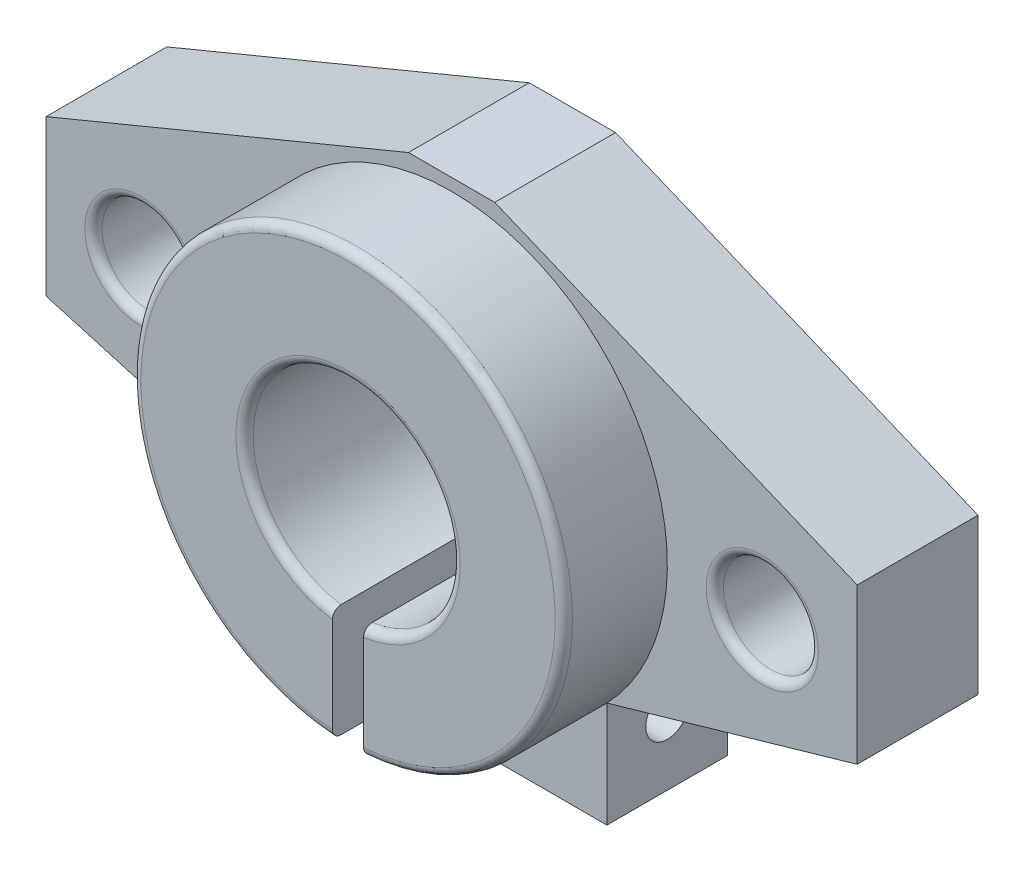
ISO-10303-21;
HEADER;
FILE_DESCRIPTION(('STEP AP214'),'2;1');
FILE_NAME('part.step','',(''),(''),'','','');
FILE_SCHEMA(('AUTOMOTIVE_DESIGN { 1 0 10303 214 1 1 1 1 }'));
ENDSEC;
DATA;
#1=APPLICATION_CONTEXT('core data for automotive mechanical design processes');
#2=APPLICATION_PROTOCOL_DEFINITION('international standard','automotive_design',2000,#1);
#3=PRODUCT_CONTEXT('',#1,'mechanical');
#4=PRODUCT('Part','Part','',(#3));
#5=PRODUCT_RELATED_PRODUCT_CATEGORY('part','',(#4));
#6=PRODUCT_DEFINITION_FORMATION('','',#4);
#7=PRODUCT_DEFINITION_CONTEXT('part definition',#1,'design');
#8=PRODUCT_DEFINITION('design','',#6,#7);
#9=PRODUCT_DEFINITION_SHAPE('','',#8);
#10=(LENGTH_UNIT() NAMED_UNIT(*) SI_UNIT(.MILLI.,.METRE.));
#11=(NAMED_UNIT(*) PLANE_ANGLE_UNIT() SI_UNIT($,.RADIAN.));
#12=(NAMED_UNIT(*) SI_UNIT($,.STERADIAN.) SOLID_ANGLE_UNIT());
#13=UNCERTAINTY_MEASURE_WITH_UNIT(LENGTH_MEASURE(1.E-05),#10,'distance_accuracy_value','');
#14=(GEOMETRIC_REPRESENTATION_CONTEXT(3) GLOBAL_UNCERTAINTY_ASSIGNED_CONTEXT((#13)) GLOBAL_UNIT_ASSIGNED_CONTEXT((#10,
#11,#12)) REPRESENTATION_CONTEXT('',''));
#15=CARTESIAN_POINT('',(0.,0.,0.));
#16=DIRECTION('',(0.,0.,1.));
#17=DIRECTION('',(1.,0.,0.));
#18=AXIS2_PLACEMENT_3D('',#15,#16,#17);
#19=CARTESIAN_POINT('',(0.,0.,7.));
#20=DIRECTION('',(0.,0.,1.));
#21=DIRECTION('',(1.,0.,0.));
#22=AXIS2_PLACEMENT_3D('',#19,#20,#21);
#23=PLANE('',#22);
#24=DIRECTION('',(0.,1.,0.));
#25=VECTOR('',#24,1.);
#26=CARTESIAN_POINT('',(9.,0.,7.));
#27=LINE('',#26,#25);
#28=CARTESIAN_POINT('',(9.,-14.801515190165,7.));
#29=VERTEX_POINT('',#28);
#30=CARTESIAN_POINT('',(8.99999999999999,-8.67467578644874,7.));
#31=VERTEX_POINT('',#30);
#32=EDGE_CURVE('E183',#29,#31,#27,.T.);
#33=ORIENTED_EDGE('',*,*,#32,.T.);
#34=CARTESIAN_POINT('',(0.,0.,7.));
#35=DIRECTION('',(0.,0.,1.));
#36=DIRECTION('',(1.,0.,0.));
#37=AXIS2_PLACEMENT_3D('',#34,#35,#36);
#38=CIRCLE('',#37,12.5);
#39=CARTESIAN_POINT('',(0.900000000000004,-12.467557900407,7.));
#40=VERTEX_POINT('',#39);
#41=EDGE_CURVE('E171',#31,#40,#38,.F.);
#42=ORIENTED_EDGE('',*,*,#41,.T.);
#43=DIRECTION('',(0.,1.,0.));
#44=VECTOR('',#43,1.);
#45=CARTESIAN_POINT('',(0.900000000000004,0.,7.));
#46=LINE('',#45,#44);
#47=CARTESIAN_POINT('',(0.900000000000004,-14.801515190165,7.));
#48=VERTEX_POINT('',#47);
#49=EDGE_CURVE('E181',#48,#40,#46,.T.);
#50=ORIENTED_EDGE('',*,*,#49,.F.);
#51=DIRECTION('',(1.,0.,0.));
#52=VECTOR('',#51,1.);
#53=CARTESIAN_POINT('',(0.,-14.801515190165,7.));
#54=LINE('',#53,#52);
#55=EDGE_CURVE('E194',#48,#29,#54,.T.);
#56=ORIENTED_EDGE('',*,*,#55,.T.);
#57=EDGE_LOOP('',(#33,#42,#50,#56));
#58=FACE_BOUND('',#57,.T.);
#59=ADVANCED_FACE('F35',(#58),#23,.T.);
#60=DIRECTION('',(0.,-1.,0.));
#61=VECTOR('',#60,1.);
#62=CARTESIAN_POINT('',(-0.899999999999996,0.,7.));
#63=LINE('',#62,#61);
#64=CARTESIAN_POINT('',(-0.899999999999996,-12.467557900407,7.));
#65=VERTEX_POINT('',#64);
#66=CARTESIAN_POINT('',(-0.899999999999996,-14.801515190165,7.));
#67=VERTEX_POINT('',#66);
#68=EDGE_CURVE('E195',#65,#67,#63,.T.);
#69=ORIENTED_EDGE('',*,*,#68,.F.);
#70=CARTESIAN_POINT('',(-9.,-8.67467578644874,7.));
#71=VERTEX_POINT('',#70);
#72=EDGE_CURVE('E186',#65,#71,#38,.F.);
#73=ORIENTED_EDGE('',*,*,#72,.T.);
#74=DIRECTION('',(0.,1.,0.));
#75=VECTOR('',#74,1.);
#76=CARTESIAN_POINT('',(-9.,0.,7.));
#77=LINE('',#76,#75);
#78=CARTESIAN_POINT('',(-9.,-14.801515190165,7.));
#79=VERTEX_POINT('',#78);
#80=EDGE_CURVE('E452',#79,#71,#77,.T.);
#81=ORIENTED_EDGE('',*,*,#80,.F.);
#82=DIRECTION('',(1.,0.,0.));
#83=VECTOR('',#82,1.);
#84=CARTESIAN_POINT('',(0.,-14.801515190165,7.));
#85=LINE('',#84,#83);
#86=EDGE_CURVE('E198',#79,#67,#85,.T.);
#87=ORIENTED_EDGE('',*,*,#86,.T.);
#88=EDGE_LOOP('',(#69,#73,#81,#87));
#89=FACE_BOUND('',#88,.T.);
#90=ADVANCED_FACE('F426',(#89),#23,.T.);
#91=CARTESIAN_POINT('',(-18.,0.,7.));
#92=DIRECTION('',(0.,0.,1.));
#93=DIRECTION('',(1.,0.,0.));
#94=AXIS2_PLACEMENT_3D('',#91,#92,#93);
#95=CIRCLE('',#94,3.25);
#96=CARTESIAN_POINT('',(-14.75,0.,7.));
#97=VERTEX_POINT('',#96);
#98=EDGE_CURVE('E386',#97,#97,#95,.F.);
#99=ORIENTED_EDGE('',*,*,#98,.T.);
#100=EDGE_LOOP('',(#99));
#101=FACE_BOUND('',#100,.T.);
#102=CARTESIAN_POINT('',(18.,0.,7.));
#103=DIRECTION('',(0.,0.,1.));
#104=DIRECTION('',(1.,0.,0.));
#105=AXIS2_PLACEMENT_3D('',#102,#103,#104);
#106=CIRCLE('',#105,3.25);
#107=CARTESIAN_POINT('',(21.25,0.,7.));
#108=VERTEX_POINT('',#107);
#109=EDGE_CURVE('E391',#108,#108,#106,.F.);
#110=ORIENTED_EDGE('',*,*,#109,.T.);
#111=EDGE_LOOP('',(#110));
#112=FACE_BOUND('',#111,.T.);
#113=DIRECTION('',(0.960964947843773,-0.276670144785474,0.));
#114=VECTOR('',#113,1.);
#115=CARTESIAN_POINT('',(-2.99525607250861,-10.4034936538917,7.));
#116=LINE('',#115,#114);
#117=CARTESIAN_POINT('',(-23.5,-4.5,7.));
#118=VERTEX_POINT('',#117);
#119=EDGE_CURVE('E253',#118,#71,#116,.T.);
#120=ORIENTED_EDGE('',*,*,#119,.T.);
#121=EDGE_CURVE('E188',#71,#31,#38,.F.);
#122=ORIENTED_EDGE('',*,*,#121,.T.);
#123=DIRECTION('',(-0.960964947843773,-0.276670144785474,0.));
#124=VECTOR('',#123,1.);
#125=CARTESIAN_POINT('',(2.99525607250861,-10.4034936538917,7.));
#126=LINE('',#125,#124);
#127=CARTESIAN_POINT('',(23.5,-4.5,7.));
#128=VERTEX_POINT('',#127);
#129=EDGE_CURVE('E203',#128,#31,#126,.T.);
#130=ORIENTED_EDGE('',*,*,#129,.F.);
#131=DIRECTION('',(0.,1.,0.));
#132=VECTOR('',#131,1.);
#133=CARTESIAN_POINT('',(23.5,0.,7.));
#134=LINE('',#133,#132);
#135=CARTESIAN_POINT('',(23.5,4.5,7.));
#136=VERTEX_POINT('',#135);
#137=EDGE_CURVE('E206',#128,#136,#134,.T.);
#138=ORIENTED_EDGE('',*,*,#137,.T.);
#139=DIRECTION('',(-0.923879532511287,0.38268343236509,0.));
#140=VECTOR('',#139,1.);
#141=CARTESIAN_POINT('',(5.03248557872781,12.1494949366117,7.));
#142=LINE('',#141,#140);
#143=CARTESIAN_POINT('',(2.5,13.198484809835,7.));
#144=VERTEX_POINT('',#143);
#145=EDGE_CURVE('E208',#136,#144,#142,.T.);
#146=ORIENTED_EDGE('',*,*,#145,.T.);
#147=DIRECTION('',(1.,0.,0.));
#148=VECTOR('',#147,1.);
#149=CARTESIAN_POINT('',(0.,13.198484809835,7.));
#150=LINE('',#149,#148);
#151=CARTESIAN_POINT('',(-2.5,13.198484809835,7.));
#152=VERTEX_POINT('',#151);
#153=EDGE_CURVE('E210',#152,#144,#150,.T.);
#154=ORIENTED_EDGE('',*,*,#153,.F.);
#155=DIRECTION('',(0.923879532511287,0.38268343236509,0.));
#156=VECTOR('',#155,1.);
#157=CARTESIAN_POINT('',(-5.03248557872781,12.1494949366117,7.));
#158=LINE('',#157,#156);
#159=CARTESIAN_POINT('',(-23.5,4.5,7.));
#160=VERTEX_POINT('',#159);
#161=EDGE_CURVE('E213',#160,#152,#158,.T.);
#162=ORIENTED_EDGE('',*,*,#161,.F.);
#163=DIRECTION('',(0.,-1.,0.));
#164=VECTOR('',#163,1.);
#165=CARTESIAN_POINT('',(-23.5,0.,7.));
#166=LINE('',#165,#164);
#167=EDGE_CURVE('E216',#160,#118,#166,.T.);
#168=ORIENTED_EDGE('',*,*,#167,.T.);
#169=EDGE_LOOP('',(#120,#122,#130,#138,#146,#154,#162,#168));
#170=FACE_BOUND('',#169,.T.);
#171=ADVANCED_FACE('F428',(#101,#112,#170),#23,.T.);
#172=CARTESIAN_POINT('',(-2.99525607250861,-10.4034936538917,7.));
#173=DIRECTION('',(0.276670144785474,0.960964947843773,0.));
#174=DIRECTION('',(-0.960964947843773,0.276670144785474,0.));
#175=AXIS2_PLACEMENT_3D('',#172,#173,#174);
#176=PLANE('',#175);
#177=DIRECTION('',(0.960964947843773,-0.276670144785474,0.));
#178=VECTOR('',#177,1.);
#179=CARTESIAN_POINT('',(-2.99525607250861,-10.4034936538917,0.));
#180=LINE('',#179,#178);
#181=CARTESIAN_POINT('',(-23.5,-4.5,0.));
#182=VERTEX_POINT('',#181);
#183=CARTESIAN_POINT('',(-9.,-8.67467578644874,0.));
#184=VERTEX_POINT('',#183);
#185=EDGE_CURVE('E185',#182,#184,#180,.T.);
#186=ORIENTED_EDGE('',*,*,#185,.T.);
#187=DIRECTION('',(0.,0.,-1.));
#188=VECTOR('',#187,1.);
#189=CARTESIAN_POINT('',(-9.,-8.67467578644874,7.));
#190=LINE('',#189,#188);
#191=EDGE_CURVE('E283',#71,#184,#190,.T.);
#192=ORIENTED_EDGE('',*,*,#191,.F.);
#193=ORIENTED_EDGE('',*,*,#119,.F.);
#194=DIRECTION('',(0.,0.,-1.));
#195=VECTOR('',#194,1.);
#196=CARTESIAN_POINT('',(-23.5,-4.5,7.));
#197=LINE('',#196,#195);
#198=EDGE_CURVE('E218',#118,#182,#197,.T.);
#199=ORIENTED_EDGE('',*,*,#198,.T.);
#200=EDGE_LOOP('',(#186,#192,#193,#199));
#201=FACE_BOUND('',#200,.T.);
#202=ADVANCED_FACE('F336',(#201),#176,.F.);
#203=CARTESIAN_POINT('',(-9.,0.,7.));
#204=DIRECTION('',(-1.,0.,0.));
#205=DIRECTION('',(0.,0.,1.));
#206=AXIS2_PLACEMENT_3D('',#203,#204,#205);
#207=PLANE('',#206);
#208=CARTESIAN_POINT('',(-9.,-11.,3.5));
#209=DIRECTION('',(-1.,0.,0.));
#210=DIRECTION('',(0.,0.,1.));
#211=AXIS2_PLACEMENT_3D('',#208,#209,#210);
#212=CIRCLE('',#211,1.25);
#213=CARTESIAN_POINT('',(-9.,-11.,4.75));
#214=VERTEX_POINT('',#213);
#215=EDGE_CURVE('E474',#214,#214,#212,.T.);
#216=ORIENTED_EDGE('',*,*,#215,.F.);
#217=EDGE_LOOP('',(#216));
#218=FACE_BOUND('',#217,.T.);
#219=DIRECTION('',(0.,1.,0.));
#220=VECTOR('',#219,1.);
#221=CARTESIAN_POINT('',(-9.,0.,0.));
#222=LINE('',#221,#220);
#223=CARTESIAN_POINT('',(-9.,-14.801515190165,0.));
#224=VERTEX_POINT('',#223);
#225=EDGE_CURVE('E221',#224,#184,#222,.T.);
#226=ORIENTED_EDGE('',*,*,#225,.F.);
#227=DIRECTION('',(0.,0.,-1.));
#228=VECTOR('',#227,1.);
#229=CARTESIAN_POINT('',(-9.,-14.801515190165,7.));
#230=LINE('',#229,#228);
#231=EDGE_CURVE('E281',#79,#224,#230,.T.);
#232=ORIENTED_EDGE('',*,*,#231,.F.);
#233=ORIENTED_EDGE('',*,*,#80,.T.);
#234=ORIENTED_EDGE('',*,*,#191,.T.);
#235=EDGE_LOOP('',(#226,#232,#233,#234));
#236=FACE_BOUND('',#235,.T.);
#237=ADVANCED_FACE('F440',(#218,#236),#207,.T.);
#238=CARTESIAN_POINT('',(0.,-14.801515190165,7.));
#239=DIRECTION('',(0.,1.,0.));
#240=DIRECTION('',(-1.,0.,0.));
#241=AXIS2_PLACEMENT_3D('',#238,#239,#240);
#242=PLANE('',#241);
#243=DIRECTION('',(1.,0.,0.));
#244=VECTOR('',#243,1.);
#245=CARTESIAN_POINT('',(0.,-14.801515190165,0.));
#246=LINE('',#245,#244);
#247=CARTESIAN_POINT('',(-0.899999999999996,-14.801515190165,0.));
#248=VERTEX_POINT('',#247);
#249=EDGE_CURVE('E224',#224,#248,#246,.T.);
#250=ORIENTED_EDGE('',*,*,#249,.T.);
#251=DIRECTION('',(0.,0.,-1.));
#252=VECTOR('',#251,1.);
#253=CARTESIAN_POINT('',(-0.899999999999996,-14.801515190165,7.));
#254=LINE('',#253,#252);
#255=EDGE_CURVE('E278',#67,#248,#254,.T.);
#256=ORIENTED_EDGE('',*,*,#255,.F.);
#257=ORIENTED_EDGE('',*,*,#86,.F.);
#258=ORIENTED_EDGE('',*,*,#231,.T.);
#259=EDGE_LOOP('',(#250,#256,#257,#258));
#260=FACE_BOUND('',#259,.T.);
#261=ADVANCED_FACE('F313',(#260),#242,.F.);
#262=CARTESIAN_POINT('',(-0.899999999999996,0.,7.));
#263=DIRECTION('',(1.,0.,0.));
#264=DIRECTION('',(0.,0.,-1.));
#265=AXIS2_PLACEMENT_3D('',#262,#263,#264);
#266=PLANE('',#265);
#267=CARTESIAN_POINT('',(-0.899999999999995,-11.,3.5));
#268=DIRECTION('',(1.,0.,0.));
#269=DIRECTION('',(0.,0.,-1.));
#270=AXIS2_PLACEMENT_3D('',#267,#268,#269);
#271=CIRCLE('',#270,1.25);
#272=CARTESIAN_POINT('',(-0.899999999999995,-11.,2.25));
#273=VERTEX_POINT('',#272);
#274=EDGE_CURVE('E468',#273,#273,#271,.T.);
#275=ORIENTED_EDGE('',*,*,#274,.F.);
#276=EDGE_LOOP('',(#275));
#277=FACE_BOUND('',#276,.T.);
#278=DIRECTION('',(0.,-1.,0.));
#279=VECTOR('',#278,1.);
#280=CARTESIAN_POINT('',(-0.899999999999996,0.,0.));
#281=LINE('',#280,#279);
#282=CARTESIAN_POINT('',(-0.899999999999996,-6.43739077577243,0.));
#283=VERTEX_POINT('',#282);
#284=EDGE_CURVE('E227',#283,#248,#281,.T.);
#285=ORIENTED_EDGE('',*,*,#284,.F.);
#286=CARTESIAN_POINT('',(-0.899999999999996,-6.43739077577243,0.));
#287=CARTESIAN_POINT('',(-0.899999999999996,-6.40875681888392,-2.28184945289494E-05));
#288=CARTESIAN_POINT('',(-0.899999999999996,-6.38012903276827,0.00241123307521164));
#289=CARTESIAN_POINT('',(-0.899999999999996,-6.32369566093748,0.0120221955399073));
#290=CARTESIAN_POINT('',(-0.899999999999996,-6.29588964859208,0.019196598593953));
#291=CARTESIAN_POINT('',(-0.899999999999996,-6.24186304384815,0.0381228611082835));
#292=CARTESIAN_POINT('',(-0.899999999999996,-6.21564332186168,0.0498772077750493));
#293=CARTESIAN_POINT('',(-0.899999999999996,-6.16556480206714,0.0776331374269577));
#294=CARTESIAN_POINT('',(-0.899999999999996,-6.14170544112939,0.0936337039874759));
#295=CARTESIAN_POINT('',(-0.899999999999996,-6.09712458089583,0.129375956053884));
#296=CARTESIAN_POINT('',(-0.899999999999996,-6.07639148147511,0.149103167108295));
#297=CARTESIAN_POINT('',(-0.899999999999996,-6.03856666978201,0.191793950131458));
#298=CARTESIAN_POINT('',(-0.899999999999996,-6.02147557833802,0.214758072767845));
#299=CARTESIAN_POINT('',(-0.899999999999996,-5.99160394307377,0.263030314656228));
#300=CARTESIAN_POINT('',(-0.899999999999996,-5.97878377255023,0.288313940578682));
#301=CARTESIAN_POINT('',(-0.899999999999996,-5.95762808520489,0.340683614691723));
#302=CARTESIAN_POINT('',(-0.899999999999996,-5.94928922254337,0.367768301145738));
#303=CARTESIAN_POINT('',(-0.899999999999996,-5.93959463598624,0.412539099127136));
#304=CARTESIAN_POINT('',(-0.899999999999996,-5.93679184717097,0.42992499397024));
#305=CARTESIAN_POINT('',(-0.899999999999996,-5.93305289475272,0.464871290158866));
#306=CARTESIAN_POINT('',(-0.899999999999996,-5.93211408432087,0.482431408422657));
#307=CARTESIAN_POINT('',(-0.899999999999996,-5.93211597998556,0.499999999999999));
#308=B_SPLINE_CURVE_WITH_KNOTS('',3,(#286,#287,#288,#289,#290,#291,#292,#293,#294,#295,#296,
#297,#298,#299,#300,#301,#302,#303,#304,#305,#306,#307),.UNSPECIFIED.,.F.,.F.,(4,2,2,2,2,2,2,2,
2,2,4),(0.,0.0857900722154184,0.171534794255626,0.257326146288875,0.343096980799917,
0.428541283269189,0.514000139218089,0.598642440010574,0.683221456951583,0.735960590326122,
0.788624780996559),.UNSPECIFIED.);
#309=CARTESIAN_POINT('',(-0.899999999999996,-5.93211597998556,0.5));
#310=VERTEX_POINT('',#309);
#311=EDGE_CURVE('E319',#283,#310,#308,.T.);
#312=ORIENTED_EDGE('',*,*,#311,.T.);
#313=DIRECTION('',(0.,0.,-1.));
#314=VECTOR('',#313,1.);
#315=CARTESIAN_POINT('',(-0.899999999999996,-5.93211597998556,7.));
#316=LINE('',#315,#314);
#317=CARTESIAN_POINT('',(-0.899999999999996,-5.93211597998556,12.5));
#318=VERTEX_POINT('',#317);
#319=EDGE_CURVE('E275',#318,#310,#316,.T.);
#320=ORIENTED_EDGE('',*,*,#319,.F.);
#321=CARTESIAN_POINT('',(-0.899999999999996,-5.93211597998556,12.5));
#322=CARTESIAN_POINT('',(-0.899999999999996,-5.9320906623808,12.5279045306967));
#323=CARTESIAN_POINT('',(-0.899999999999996,-5.93447713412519,12.5557998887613));
#324=CARTESIAN_POINT('',(-0.899999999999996,-5.94388435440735,12.6107671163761));
#325=CARTESIAN_POINT('',(-0.899999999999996,-5.95089990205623,12.6378398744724));
#326=CARTESIAN_POINT('',(-0.899999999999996,-5.96938008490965,12.6904323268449));
#327=CARTESIAN_POINT('',(-0.899999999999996,-5.98084632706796,12.7159514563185));
#328=CARTESIAN_POINT('',(-0.899999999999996,-6.00787571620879,12.7647140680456));
#329=CARTESIAN_POINT('',(-0.899999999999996,-6.02343853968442,12.787957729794));
#330=CARTESIAN_POINT('',(-0.899999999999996,-6.05829879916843,12.8316496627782));
#331=CARTESIAN_POINT('',(-0.899999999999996,-6.0776152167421,12.8520827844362));
#332=CARTESIAN_POINT('',(-0.899999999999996,-6.11937626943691,12.8894611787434));
#333=CARTESIAN_POINT('',(-0.899999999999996,-6.14182158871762,12.9064056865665));
#334=CARTESIAN_POINT('',(-0.899999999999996,-6.18945526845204,12.9365121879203));
#335=CARTESIAN_POINT('',(-0.899999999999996,-6.21467041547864,12.9496317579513));
#336=CARTESIAN_POINT('',(-0.899999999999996,-6.2669279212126,12.971488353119));
#337=CARTESIAN_POINT('',(-0.899999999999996,-6.29396944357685,12.9802273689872));
#338=CARTESIAN_POINT('',(-0.899999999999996,-6.34052020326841,12.9910928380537));
#339=CARTESIAN_POINT('',(-0.899999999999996,-6.35975579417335,12.9944306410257));
#340=CARTESIAN_POINT('',(-0.899999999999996,-6.39845534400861,12.9988841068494));
#341=CARTESIAN_POINT('',(-0.899999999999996,-6.41791894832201,13.000002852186));
#342=CARTESIAN_POINT('',(-0.899999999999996,-6.43739077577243,13.));
#343=B_SPLINE_CURVE_WITH_KNOTS('',3,(#321,#322,#323,#324,#325,#326,#327,#328,#329,#330,#331,
#332,#333,#334,#335,#336,#337,#338,#339,#340,#341,#342),.UNSPECIFIED.,.F.,.F.,(4,2,2,2,2,2,2,2,
2,2,4),(0.,0.0835981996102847,0.16710263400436,0.250637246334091,0.334165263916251,
0.418127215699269,0.502107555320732,0.586986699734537,0.671827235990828,0.730275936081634,
0.788643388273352),.UNSPECIFIED.);
#344=CARTESIAN_POINT('',(-0.899999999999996,-6.43739077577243,13.));
#345=VERTEX_POINT('',#344);
#346=EDGE_CURVE('E294',#318,#345,#343,.T.);
#347=ORIENTED_EDGE('',*,*,#346,.T.);
#348=DIRECTION('',(0.,-1.,0.));
#349=VECTOR('',#348,1.);
#350=CARTESIAN_POINT('',(-0.899999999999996,0.,13.));
#351=LINE('',#350,#349);
#352=CARTESIAN_POINT('',(-0.899999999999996,-11.9662024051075,13.));
#353=VERTEX_POINT('',#352);
#354=EDGE_CURVE('E466',#345,#353,#351,.T.);
#355=ORIENTED_EDGE('',*,*,#354,.T.);
#356=CARTESIAN_POINT('',(-0.899999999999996,-11.9662024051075,13.));
#357=CARTESIAN_POINT('',(-0.899999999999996,-11.9944646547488,13.0000236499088));
#358=CARTESIAN_POINT('',(-0.899999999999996,-12.0227203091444,12.9976186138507));
#359=CARTESIAN_POINT('',(-0.899999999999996,-12.0784140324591,12.9881244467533));
#360=CARTESIAN_POINT('',(-0.899999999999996,-12.1058526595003,12.9810385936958));
#361=CARTESIAN_POINT('',(-0.899999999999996,-12.1591633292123,12.9623508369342));
#362=CARTESIAN_POINT('',(-0.899999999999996,-12.1850345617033,12.9507466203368));
#363=CARTESIAN_POINT('',(-0.899999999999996,-12.2344534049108,12.9233575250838));
#364=CARTESIAN_POINT('',(-0.899999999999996,-12.2580014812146,12.9075734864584));
#365=CARTESIAN_POINT('',(-0.899999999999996,-12.3020752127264,12.8722904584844));
#366=CARTESIAN_POINT('',(-0.899999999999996,-12.3226048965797,12.852796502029));
#367=CARTESIAN_POINT('',(-0.899999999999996,-12.360094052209,12.8106260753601));
#368=CARTESIAN_POINT('',(-0.899999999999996,-12.3770528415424,12.7879489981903));
#369=CARTESIAN_POINT('',(-0.899999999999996,-12.4068694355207,12.7401203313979));
#370=CARTESIAN_POINT('',(-0.899999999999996,-12.4197368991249,12.714974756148));
#371=CARTESIAN_POINT('',(-0.899999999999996,-12.4410494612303,12.6628820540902));
#372=CARTESIAN_POINT('',(-0.899999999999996,-12.4494973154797,12.6359360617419));
#373=CARTESIAN_POINT('',(-0.899999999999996,-12.4595842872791,12.5906816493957));
#374=CARTESIAN_POINT('',(-0.899999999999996,-12.4625725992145,12.572662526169));
#375=CARTESIAN_POINT('',(-0.899999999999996,-12.4665591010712,12.5364315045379));
#376=CARTESIAN_POINT('',(-0.899999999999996,-12.4675601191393,12.5182199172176));
#377=CARTESIAN_POINT('',(-0.899999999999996,-12.467557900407,12.5));
#378=B_SPLINE_CURVE_WITH_KNOTS('',3,(#356,#357,#358,#359,#360,#361,#362,#363,#364,#365,#366,
#367,#368,#369,#370,#371,#372,#373,#374,#375,#376,#377),.UNSPECIFIED.,.F.,.F.,(4,2,2,2,2,2,2,2,
2,2,4),(0.,0.0846752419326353,0.169291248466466,0.253950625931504,0.338593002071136,
0.423121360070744,0.50766585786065,0.592009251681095,0.676299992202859,0.730993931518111,
0.785609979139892),.UNSPECIFIED.);
#379=CARTESIAN_POINT('',(-0.899999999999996,-12.467557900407,12.5));
#380=VERTEX_POINT('',#379);
#381=EDGE_CURVE('E301',#353,#380,#378,.T.);
#382=ORIENTED_EDGE('',*,*,#381,.T.);
#383=DIRECTION('',(0.,0.,-1.));
#384=VECTOR('',#383,1.);
#385=CARTESIAN_POINT('',(-0.899999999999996,-12.467557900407,13.));
#386=LINE('',#385,#384);
#387=EDGE_CURVE('E175',#380,#65,#386,.T.);
#388=ORIENTED_EDGE('',*,*,#387,.T.);
#389=ORIENTED_EDGE('',*,*,#68,.T.);
#390=ORIENTED_EDGE('',*,*,#255,.T.);
#391=EDGE_LOOP('',(#285,#312,#320,#347,#355,#382,#388,#389,#390));
#392=FACE_BOUND('',#391,.T.);
#393=ADVANCED_FACE('F307',(#277,#392),#266,.T.);
#394=CARTESIAN_POINT('',(0.,0.,7.));
#395=DIRECTION('',(0.,0.,-1.));
#396=DIRECTION('',(-1.,0.,0.));
#397=AXIS2_PLACEMENT_3D('',#394,#395,#396);
#398=CYLINDRICAL_SURFACE('',#397,6.);
#399=ORIENTED_EDGE('',*,*,#319,.T.);
#400=CARTESIAN_POINT('',(0.,0.,0.5));
#401=DIRECTION('',(0.,0.,1.));
#402=DIRECTION('',(1.,0.,0.));
#403=AXIS2_PLACEMENT_3D('',#400,#401,#402);
#404=CIRCLE('',#403,6.);
#405=CARTESIAN_POINT('',(0.900000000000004,-5.93211597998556,0.5));
#406=VERTEX_POINT('',#405);
#407=EDGE_CURVE('E367',#310,#406,#404,.F.);
#408=ORIENTED_EDGE('',*,*,#407,.T.);
#409=DIRECTION('',(0.,0.,-1.));
#410=VECTOR('',#409,1.);
#411=CARTESIAN_POINT('',(0.900000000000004,-5.93211597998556,7.));
#412=LINE('',#411,#410);
#413=CARTESIAN_POINT('',(0.900000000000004,-5.93211597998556,12.5));
#414=VERTEX_POINT('',#413);
#415=EDGE_CURVE('E273',#414,#406,#412,.T.);
#416=ORIENTED_EDGE('',*,*,#415,.F.);
#417=CARTESIAN_POINT('',(0.,0.,12.5));
#418=DIRECTION('',(0.,0.,1.));
#419=DIRECTION('',(1.,0.,0.));
#420=AXIS2_PLACEMENT_3D('',#417,#418,#419);
#421=CIRCLE('',#420,6.);
#422=EDGE_CURVE('E326',#414,#318,#421,.T.);
#423=ORIENTED_EDGE('',*,*,#422,.T.);
#424=EDGE_LOOP('',(#399,#408,#416,#423));
#425=FACE_BOUND('',#424,.T.);
#426=ADVANCED_FACE('F312',(#425),#398,.F.);
#427=CARTESIAN_POINT('',(0.900000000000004,0.,7.));
#428=DIRECTION('',(-1.,0.,0.));
#429=DIRECTION('',(0.,0.,1.));
#430=AXIS2_PLACEMENT_3D('',#427,#428,#429);
#431=PLANE('',#430);
#432=CARTESIAN_POINT('',(0.900000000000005,-11.,3.5));
#433=DIRECTION('',(-1.,0.,0.));
#434=DIRECTION('',(0.,0.,1.));
#435=AXIS2_PLACEMENT_3D('',#432,#433,#434);
#436=CIRCLE('',#435,1.25);
#437=CARTESIAN_POINT('',(0.900000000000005,-11.,4.75));
#438=VERTEX_POINT('',#437);
#439=EDGE_CURVE('E471',#438,#438,#436,.T.);
#440=ORIENTED_EDGE('',*,*,#439,.F.);
#441=EDGE_LOOP('',(#440));
#442=FACE_BOUND('',#441,.T.);
#443=ORIENTED_EDGE('',*,*,#415,.T.);
#444=CARTESIAN_POINT('',(0.900000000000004,-5.93211597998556,0.5));
#445=CARTESIAN_POINT('',(0.900000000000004,-5.9320906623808,0.472095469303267));
#446=CARTESIAN_POINT('',(0.900000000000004,-5.93447713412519,0.444200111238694));
#447=CARTESIAN_POINT('',(0.900000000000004,-5.94388435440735,0.389232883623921));
#448=CARTESIAN_POINT('',(0.900000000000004,-5.95089990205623,0.362160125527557));
#449=CARTESIAN_POINT('',(0.900000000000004,-5.96938008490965,0.30956767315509));
#450=CARTESIAN_POINT('',(0.900000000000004,-5.98084632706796,0.284048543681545));
#451=CARTESIAN_POINT('',(0.900000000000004,-6.00787571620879,0.235285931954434));
#452=CARTESIAN_POINT('',(0.900000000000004,-6.02343853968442,0.212042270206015));
#453=CARTESIAN_POINT('',(0.900000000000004,-6.05829879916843,0.168350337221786));
#454=CARTESIAN_POINT('',(0.900000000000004,-6.0776152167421,0.147917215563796));
#455=CARTESIAN_POINT('',(0.900000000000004,-6.11937626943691,0.110538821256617));
#456=CARTESIAN_POINT('',(0.900000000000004,-6.14182158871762,0.0935943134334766));
#457=CARTESIAN_POINT('',(0.900000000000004,-6.18945526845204,0.0634878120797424));
#458=CARTESIAN_POINT('',(0.900000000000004,-6.21467041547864,0.0503682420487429));
#459=CARTESIAN_POINT('',(0.900000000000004,-6.2669279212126,0.0285116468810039));
#460=CARTESIAN_POINT('',(0.900000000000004,-6.29396944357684,0.0197726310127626));
#461=CARTESIAN_POINT('',(0.900000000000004,-6.3405202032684,0.00890716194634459));
#462=CARTESIAN_POINT('',(0.900000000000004,-6.35975579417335,0.00556935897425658));
#463=CARTESIAN_POINT('',(0.900000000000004,-6.39845534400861,0.00111589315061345));
#464=CARTESIAN_POINT('',(0.900000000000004,-6.41791894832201,-2.8521859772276E-06));
#465=CARTESIAN_POINT('',(0.900000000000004,-6.43739077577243,0.));
#466=B_SPLINE_CURVE_WITH_KNOTS('',3,(#444,#445,#446,#447,#448,#449,#450,#451,#452,#453,#454,
#455,#456,#457,#458,#459,#460,#461,#462,#463,#464,#465),.UNSPECIFIED.,.F.,.F.,(4,2,2,2,2,2,2,2,
2,2,4),(0.,0.0835981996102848,0.167102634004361,0.25063724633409,0.33416526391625,
0.418127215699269,0.502107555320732,0.586986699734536,0.671827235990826,0.730275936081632,
0.788643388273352),.UNSPECIFIED.);
#467=CARTESIAN_POINT('',(0.900000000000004,-6.43739077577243,0.));
#468=VERTEX_POINT('',#467);
#469=EDGE_CURVE('E340',#406,#468,#466,.T.);
#470=ORIENTED_EDGE('',*,*,#469,.T.);
#471=DIRECTION('',(0.,1.,0.));
#472=VECTOR('',#471,1.);
#473=CARTESIAN_POINT('',(0.900000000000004,0.,0.));
#474=LINE('',#473,#472);
#475=CARTESIAN_POINT('',(0.900000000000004,-14.801515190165,0.));
#476=VERTEX_POINT('',#475);
#477=EDGE_CURVE('E229',#476,#468,#474,.T.);
#478=ORIENTED_EDGE('',*,*,#477,.F.);
#479=DIRECTION('',(0.,0.,-1.));
#480=VECTOR('',#479,1.);
#481=CARTESIAN_POINT('',(0.900000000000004,-14.801515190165,7.));
#482=LINE('',#481,#480);
#483=EDGE_CURVE('E192',#48,#476,#482,.T.);
#484=ORIENTED_EDGE('',*,*,#483,.F.);
#485=ORIENTED_EDGE('',*,*,#49,.T.);
#486=DIRECTION('',(0.,0.,-1.));
#487=VECTOR('',#486,1.);
#488=CARTESIAN_POINT('',(0.900000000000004,-12.467557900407,13.));
#489=LINE('',#488,#487);
#490=CARTESIAN_POINT('',(0.900000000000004,-12.467557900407,12.5));
#491=VERTEX_POINT('',#490);
#492=EDGE_CURVE('E167',#491,#40,#489,.T.);
#493=ORIENTED_EDGE('',*,*,#492,.F.);
#494=CARTESIAN_POINT('',(0.900000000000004,-12.467557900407,12.5));
#495=CARTESIAN_POINT('',(0.900000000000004,-12.4675820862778,12.5280756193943));
#496=CARTESIAN_POINT('',(0.900000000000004,-12.4651884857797,12.5561436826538));
#497=CARTESIAN_POINT('',(0.900000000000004,-12.4557446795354,12.6114615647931));
#498=CARTESIAN_POINT('',(0.900000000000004,-12.4486984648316,12.6387120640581));
#499=CARTESIAN_POINT('',(0.900000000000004,-12.4301236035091,12.691654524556));
#500=CARTESIAN_POINT('',(0.900000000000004,-12.4185929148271,12.717345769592));
#501=CARTESIAN_POINT('',(0.900000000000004,-12.3913901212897,12.7664270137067));
#502=CARTESIAN_POINT('',(0.900000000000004,-12.3757186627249,12.7898173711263));
#503=CARTESIAN_POINT('',(0.900000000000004,-12.3406601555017,12.8336671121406));
#504=CARTESIAN_POINT('',(0.900000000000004,-12.3212690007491,12.8541232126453));
#505=CARTESIAN_POINT('',(0.900000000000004,-12.2793308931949,12.8915033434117));
#506=CARTESIAN_POINT('',(0.900000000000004,-12.2567833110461,12.9084266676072));
#507=CARTESIAN_POINT('',(0.900000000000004,-12.2091145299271,12.9383031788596));
#508=CARTESIAN_POINT('',(0.900000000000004,-12.1839866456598,12.9512456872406));
#509=CARTESIAN_POINT('',(0.900000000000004,-12.131922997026,12.9727339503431));
#510=CARTESIAN_POINT('',(0.900000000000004,-12.1049882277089,12.9812821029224));
#511=CARTESIAN_POINT('',(0.900000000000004,-12.0592806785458,12.9916649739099));
#512=CARTESIAN_POINT('',(0.900000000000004,-12.0407903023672,12.9947887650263));
#513=CARTESIAN_POINT('',(0.900000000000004,-12.0036032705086,12.9989560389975));
#514=CARTESIAN_POINT('',(0.900000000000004,-11.9849069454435,13.0000024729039));
#515=CARTESIAN_POINT('',(0.900000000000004,-11.9662024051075,13.));
#516=B_SPLINE_CURVE_WITH_KNOTS('',3,(#494,#495,#496,#497,#498,#499,#500,#501,#502,#503,#504,
#505,#506,#507,#508,#509,#510,#511,#512,#513,#514,#515),.UNSPECIFIED.,.F.,.F.,(4,2,2,2,2,2,2,2,
2,2,4),(0.,0.0841141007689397,0.168156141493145,0.252236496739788,0.336303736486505,
0.420464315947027,0.504641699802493,0.589042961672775,0.673398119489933,0.729546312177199,
0.785614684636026),.UNSPECIFIED.);
#517=CARTESIAN_POINT('',(0.900000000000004,-11.9662024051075,13.));
#518=VERTEX_POINT('',#517);
#519=EDGE_CURVE('E59',#491,#518,#516,.T.);
#520=ORIENTED_EDGE('',*,*,#519,.T.);
#521=DIRECTION('',(0.,1.,0.));
#522=VECTOR('',#521,1.);
#523=CARTESIAN_POINT('',(0.900000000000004,0.,13.));
#524=LINE('',#523,#522);
#525=CARTESIAN_POINT('',(0.900000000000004,-6.43739077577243,13.));
#526=VERTEX_POINT('',#525);
#527=EDGE_CURVE('E176',#518,#526,#524,.T.);
#528=ORIENTED_EDGE('',*,*,#527,.T.);
#529=CARTESIAN_POINT('',(0.900000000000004,-6.43739077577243,13.));
#530=CARTESIAN_POINT('',(0.900000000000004,-6.40875681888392,13.0000228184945));
#531=CARTESIAN_POINT('',(0.900000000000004,-6.38012903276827,12.9975887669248));
#532=CARTESIAN_POINT('',(0.900000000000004,-6.32369566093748,12.9879778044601));
#533=CARTESIAN_POINT('',(0.900000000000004,-6.29588964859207,12.980803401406));
#534=CARTESIAN_POINT('',(0.900000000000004,-6.24186304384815,12.9618771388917));
#535=CARTESIAN_POINT('',(0.900000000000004,-6.21564332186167,12.9501227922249));
#536=CARTESIAN_POINT('',(0.900000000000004,-6.16556480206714,12.922366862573));
#537=CARTESIAN_POINT('',(0.900000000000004,-6.14170544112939,12.9063662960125));
#538=CARTESIAN_POINT('',(0.900000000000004,-6.09712458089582,12.8706240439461));
#539=CARTESIAN_POINT('',(0.900000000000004,-6.07639148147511,12.8508968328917));
#540=CARTESIAN_POINT('',(0.900000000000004,-6.03856666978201,12.8082060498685));
#541=CARTESIAN_POINT('',(0.900000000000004,-6.02147557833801,12.7852419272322));
#542=CARTESIAN_POINT('',(0.900000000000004,-5.99160394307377,12.7369696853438));
#543=CARTESIAN_POINT('',(0.900000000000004,-5.97878377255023,12.7116860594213));
#544=CARTESIAN_POINT('',(0.900000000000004,-5.95762808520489,12.6593163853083));
#545=CARTESIAN_POINT('',(0.900000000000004,-5.94928922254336,12.6322316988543));
#546=CARTESIAN_POINT('',(0.900000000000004,-5.93959463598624,12.5874609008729));
#547=CARTESIAN_POINT('',(0.900000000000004,-5.93679184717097,12.5700750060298));
#548=CARTESIAN_POINT('',(0.900000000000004,-5.93305289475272,12.5351287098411));
#549=CARTESIAN_POINT('',(0.900000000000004,-5.93211408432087,12.5175685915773));
#550=CARTESIAN_POINT('',(0.900000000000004,-5.93211597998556,12.5));
#551=B_SPLINE_CURVE_WITH_KNOTS('',3,(#529,#530,#531,#532,#533,#534,#535,#536,#537,#538,#539,
#540,#541,#542,#543,#544,#545,#546,#547,#548,#549,#550),.UNSPECIFIED.,.F.,.F.,(4,2,2,2,2,2,2,2,
2,2,4),(0.,0.0857900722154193,0.171534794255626,0.257326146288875,0.343096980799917,
0.428541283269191,0.51400013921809,0.598642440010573,0.683221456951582,0.735960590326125,
0.78862478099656),.UNSPECIFIED.);
#552=EDGE_CURVE('E362',#526,#414,#551,.T.);
#553=ORIENTED_EDGE('',*,*,#552,.T.);
#554=EDGE_LOOP('',(#443,#470,#478,#484,#485,#493,#520,#528,#553));
#555=FACE_BOUND('',#554,.T.);
#556=ADVANCED_FACE('F190',(#442,#555),#431,.T.);
#557=CARTESIAN_POINT('',(0.,-14.801515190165,7.));
#558=DIRECTION('',(0.,1.,0.));
#559=DIRECTION('',(-1.,0.,0.));
#560=AXIS2_PLACEMENT_3D('',#557,#558,#559);
#561=PLANE('',#560);
#562=DIRECTION('',(1.,0.,0.));
#563=VECTOR('',#562,1.);
#564=CARTESIAN_POINT('',(0.,-14.801515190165,0.));
#565=LINE('',#564,#563);
#566=CARTESIAN_POINT('',(9.,-14.801515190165,0.));
#567=VERTEX_POINT('',#566);
#568=EDGE_CURVE('E232',#476,#567,#565,.T.);
#569=ORIENTED_EDGE('',*,*,#568,.T.);
#570=DIRECTION('',(0.,0.,-1.));
#571=VECTOR('',#570,1.);
#572=CARTESIAN_POINT('',(9.,-14.801515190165,7.));
#573=LINE('',#572,#571);
#574=EDGE_CURVE('E269',#29,#567,#573,.T.);
#575=ORIENTED_EDGE('',*,*,#574,.F.);
#576=ORIENTED_EDGE('',*,*,#55,.F.);
#577=ORIENTED_EDGE('',*,*,#483,.T.);
#578=EDGE_LOOP('',(#569,#575,#576,#577));
#579=FACE_BOUND('',#578,.T.);
#580=ADVANCED_FACE('F357',(#579),#561,.F.);
#581=CARTESIAN_POINT('',(9.,0.,7.));
#582=DIRECTION('',(-1.,0.,0.));
#583=DIRECTION('',(0.,0.,1.));
#584=AXIS2_PLACEMENT_3D('',#581,#582,#583);
#585=PLANE('',#584);
#586=CARTESIAN_POINT('',(9.,-11.,3.5));
#587=DIRECTION('',(-1.,0.,0.));
#588=DIRECTION('',(0.,0.,1.));
#589=AXIS2_PLACEMENT_3D('',#586,#587,#588);
#590=CIRCLE('',#589,1.25);
#591=CARTESIAN_POINT('',(9.,-11.,4.75));
#592=VERTEX_POINT('',#591);
#593=EDGE_CURVE('E40',#592,#592,#590,.T.);
#594=ORIENTED_EDGE('',*,*,#593,.T.);
#595=EDGE_LOOP('',(#594));
#596=FACE_BOUND('',#595,.T.);
#597=DIRECTION('',(0.,1.,0.));
#598=VECTOR('',#597,1.);
#599=CARTESIAN_POINT('',(9.,0.,0.));
#600=LINE('',#599,#598);
#601=CARTESIAN_POINT('',(9.,-8.67467578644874,0.));
#602=VERTEX_POINT('',#601);
#603=EDGE_CURVE('E234',#567,#602,#600,.T.);
#604=ORIENTED_EDGE('',*,*,#603,.T.);
#605=DIRECTION('',(0.,0.,-1.));
#606=VECTOR('',#605,1.);
#607=CARTESIAN_POINT('',(9.,-8.67467578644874,7.));
#608=LINE('',#607,#606);
#609=EDGE_CURVE('E267',#31,#602,#608,.T.);
#610=ORIENTED_EDGE('',*,*,#609,.F.);
#611=ORIENTED_EDGE('',*,*,#32,.F.);
#612=ORIENTED_EDGE('',*,*,#574,.T.);
#613=EDGE_LOOP('',(#604,#610,#611,#612));
#614=FACE_BOUND('',#613,.T.);
#615=ADVANCED_FACE('F481',(#596,#614),#585,.F.);
#616=CARTESIAN_POINT('',(2.99525607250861,-10.4034936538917,7.));
#617=DIRECTION('',(0.276670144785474,-0.960964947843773,0.));
#618=DIRECTION('',(0.960964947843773,0.276670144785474,0.));
#619=AXIS2_PLACEMENT_3D('',#616,#617,#618);
#620=PLANE('',#619);
#621=DIRECTION('',(-0.960964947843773,-0.276670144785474,0.));
#622=VECTOR('',#621,1.);
#623=CARTESIAN_POINT('',(2.99525607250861,-10.4034936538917,0.));
#624=LINE('',#623,#622);
#625=CARTESIAN_POINT('',(23.5,-4.5,0.));
#626=VERTEX_POINT('',#625);
#627=EDGE_CURVE('E237',#626,#602,#624,.T.);
#628=ORIENTED_EDGE('',*,*,#627,.F.);
#629=DIRECTION('',(0.,0.,-1.));
#630=VECTOR('',#629,1.);
#631=CARTESIAN_POINT('',(23.5,-4.5,7.));
#632=LINE('',#631,#630);
#633=EDGE_CURVE('E265',#128,#626,#632,.T.);
#634=ORIENTED_EDGE('',*,*,#633,.F.);
#635=ORIENTED_EDGE('',*,*,#129,.T.);
#636=ORIENTED_EDGE('',*,*,#609,.T.);
#637=EDGE_LOOP('',(#628,#634,#635,#636));
#638=FACE_BOUND('',#637,.T.);
#639=ADVANCED_FACE('F530',(#638),#620,.T.);
#640=CARTESIAN_POINT('',(23.5,0.,7.));
#641=DIRECTION('',(-1.,0.,0.));
#642=DIRECTION('',(0.,0.,1.));
#643=AXIS2_PLACEMENT_3D('',#640,#641,#642);
#644=PLANE('',#643);
#645=DIRECTION('',(0.,1.,0.));
#646=VECTOR('',#645,1.);
#647=CARTESIAN_POINT('',(23.5,0.,0.));
#648=LINE('',#647,#646);
#649=CARTESIAN_POINT('',(23.5,4.5,0.));
#650=VERTEX_POINT('',#649);
#651=EDGE_CURVE('E240',#626,#650,#648,.T.);
#652=ORIENTED_EDGE('',*,*,#651,.T.);
#653=DIRECTION('',(0.,0.,-1.));
#654=VECTOR('',#653,1.);
#655=CARTESIAN_POINT('',(23.5,4.5,7.));
#656=LINE('',#655,#654);
#657=EDGE_CURVE('E262',#136,#650,#656,.T.);
#658=ORIENTED_EDGE('',*,*,#657,.F.);
#659=ORIENTED_EDGE('',*,*,#137,.F.);
#660=ORIENTED_EDGE('',*,*,#633,.T.);
#661=EDGE_LOOP('',(#652,#658,#659,#660));
#662=FACE_BOUND('',#661,.T.);
#663=ADVANCED_FACE('F526',(#662),#644,.F.);
#664=CARTESIAN_POINT('',(5.03248557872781,12.1494949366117,7.));
#665=DIRECTION('',(-0.38268343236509,-0.923879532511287,0.));
#666=DIRECTION('',(0.923879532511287,-0.38268343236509,0.));
#667=AXIS2_PLACEMENT_3D('',#664,#665,#666);
#668=PLANE('',#667);
#669=DIRECTION('',(-0.923879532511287,0.38268343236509,0.));
#670=VECTOR('',#669,1.);
#671=CARTESIAN_POINT('',(5.03248557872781,12.1494949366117,0.));
#672=LINE('',#671,#670);
#673=CARTESIAN_POINT('',(2.5,13.198484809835,0.));
#674=VERTEX_POINT('',#673);
#675=EDGE_CURVE('E242',#650,#674,#672,.T.);
#676=ORIENTED_EDGE('',*,*,#675,.T.);
#677=DIRECTION('',(0.,0.,-1.));
#678=VECTOR('',#677,1.);
#679=CARTESIAN_POINT('',(2.5,13.198484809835,7.));
#680=LINE('',#679,#678);
#681=EDGE_CURVE('E260',#144,#674,#680,.T.);
#682=ORIENTED_EDGE('',*,*,#681,.F.);
#683=ORIENTED_EDGE('',*,*,#145,.F.);
#684=ORIENTED_EDGE('',*,*,#657,.T.);
#685=EDGE_LOOP('',(#676,#682,#683,#684));
#686=FACE_BOUND('',#685,.T.);
#687=ADVANCED_FACE('F522',(#686),#668,.F.);
#688=CARTESIAN_POINT('',(0.,13.198484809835,7.));
#689=DIRECTION('',(0.,1.,0.));
#690=DIRECTION('',(0.,0.,1.));
#691=AXIS2_PLACEMENT_3D('',#688,#689,#690);
#692=PLANE('',#691);
#693=DIRECTION('',(1.,0.,0.));
#694=VECTOR('',#693,1.);
#695=CARTESIAN_POINT('',(0.,13.198484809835,0.));
#696=LINE('',#695,#694);
#697=CARTESIAN_POINT('',(-2.5,13.198484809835,0.));
#698=VERTEX_POINT('',#697);
#699=EDGE_CURVE('E245',#698,#674,#696,.T.);
#700=ORIENTED_EDGE('',*,*,#699,.F.);
#701=DIRECTION('',(0.,0.,-1.));
#702=VECTOR('',#701,1.);
#703=CARTESIAN_POINT('',(-2.5,13.198484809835,7.));
#704=LINE('',#703,#702);
#705=EDGE_CURVE('E258',#152,#698,#704,.T.);
#706=ORIENTED_EDGE('',*,*,#705,.F.);
#707=ORIENTED_EDGE('',*,*,#153,.T.);
#708=ORIENTED_EDGE('',*,*,#681,.T.);
#709=EDGE_LOOP('',(#700,#706,#707,#708));
#710=FACE_BOUND('',#709,.T.);
#711=ADVANCED_FACE('F518',(#710),#692,.T.);
#712=CARTESIAN_POINT('',(-5.03248557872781,12.1494949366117,7.));
#713=DIRECTION('',(-0.38268343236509,0.923879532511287,0.));
#714=DIRECTION('',(-0.923879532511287,-0.38268343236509,0.));
#715=AXIS2_PLACEMENT_3D('',#712,#713,#714);
#716=PLANE('',#715);
#717=DIRECTION('',(0.923879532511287,0.38268343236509,0.));
#718=VECTOR('',#717,1.);
#719=CARTESIAN_POINT('',(-5.03248557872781,12.1494949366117,0.));
#720=LINE('',#719,#718);
#721=CARTESIAN_POINT('',(-23.5,4.5,0.));
#722=VERTEX_POINT('',#721);
#723=EDGE_CURVE('E248',#722,#698,#720,.T.);
#724=ORIENTED_EDGE('',*,*,#723,.F.);
#725=DIRECTION('',(0.,0.,-1.));
#726=VECTOR('',#725,1.);
#727=CARTESIAN_POINT('',(-23.5,4.5,7.));
#728=LINE('',#727,#726);
#729=EDGE_CURVE('E256',#160,#722,#728,.T.);
#730=ORIENTED_EDGE('',*,*,#729,.F.);
#731=ORIENTED_EDGE('',*,*,#161,.T.);
#732=ORIENTED_EDGE('',*,*,#705,.T.);
#733=EDGE_LOOP('',(#724,#730,#731,#732));
#734=FACE_BOUND('',#733,.T.);
#735=ADVANCED_FACE('F512',(#734),#716,.T.);
#736=CARTESIAN_POINT('',(18.,0.,7.));
#737=DIRECTION('',(0.,0.,-1.));
#738=DIRECTION('',(-1.,0.,0.));
#739=AXIS2_PLACEMENT_3D('',#736,#737,#738);
#740=CYLINDRICAL_SURFACE('',#739,2.75);
#741=CARTESIAN_POINT('',(18.,0.,0.5));
#742=DIRECTION('',(0.,0.,1.));
#743=DIRECTION('',(1.,0.,0.));
#744=AXIS2_PLACEMENT_3D('',#741,#742,#743);
#745=CIRCLE('',#744,2.75);
#746=CARTESIAN_POINT('',(20.75,0.,0.5));
#747=VERTEX_POINT('',#746);
#748=EDGE_CURVE('E401',#747,#747,#745,.F.);
#749=ORIENTED_EDGE('',*,*,#748,.T.);
#750=EDGE_LOOP('',(#749));
#751=FACE_BOUND('',#750,.T.);
#752=CARTESIAN_POINT('',(18.,0.,6.5));
#753=DIRECTION('',(0.,0.,1.));
#754=DIRECTION('',(1.,0.,0.));
#755=AXIS2_PLACEMENT_3D('',#752,#753,#754);
#756=CIRCLE('',#755,2.75);
#757=CARTESIAN_POINT('',(20.75,0.,6.5));
#758=VERTEX_POINT('',#757);
#759=EDGE_CURVE('E347',#758,#758,#756,.T.);
#760=ORIENTED_EDGE('',*,*,#759,.T.);
#761=EDGE_LOOP('',(#760));
#762=FACE_BOUND('',#761,.T.);
#763=ADVANCED_FACE('F408',(#751,#762),#740,.F.);
#764=CARTESIAN_POINT('',(-23.5,0.,7.));
#765=DIRECTION('',(1.,0.,0.));
#766=DIRECTION('',(0.,0.,-1.));
#767=AXIS2_PLACEMENT_3D('',#764,#765,#766);
#768=PLANE('',#767);
#769=DIRECTION('',(0.,-1.,0.));
#770=VECTOR('',#769,1.);
#771=CARTESIAN_POINT('',(-23.5,0.,0.));
#772=LINE('',#771,#770);
#773=EDGE_CURVE('E251',#722,#182,#772,.T.);
#774=ORIENTED_EDGE('',*,*,#773,.T.);
#775=ORIENTED_EDGE('',*,*,#198,.F.);
#776=ORIENTED_EDGE('',*,*,#167,.F.);
#777=ORIENTED_EDGE('',*,*,#729,.T.);
#778=EDGE_LOOP('',(#774,#775,#776,#777));
#779=FACE_BOUND('',#778,.T.);
#780=ADVANCED_FACE('F505',(#779),#768,.F.);
#781=CARTESIAN_POINT('',(-18.,0.,7.));
#782=DIRECTION('',(0.,0.,-1.));
#783=DIRECTION('',(-1.,0.,0.));
#784=AXIS2_PLACEMENT_3D('',#781,#782,#783);
#785=CYLINDRICAL_SURFACE('',#784,2.75);
#786=CARTESIAN_POINT('',(-18.,0.,0.5));
#787=DIRECTION('',(0.,0.,1.));
#788=DIRECTION('',(1.,0.,0.));
#789=AXIS2_PLACEMENT_3D('',#786,#787,#788);
#790=CIRCLE('',#789,2.75);
#791=CARTESIAN_POINT('',(-15.25,0.,0.5));
#792=VERTEX_POINT('',#791);
#793=EDGE_CURVE('E396',#792,#792,#790,.F.);
#794=ORIENTED_EDGE('',*,*,#793,.T.);
#795=EDGE_LOOP('',(#794));
#796=FACE_BOUND('',#795,.T.);
#797=CARTESIAN_POINT('',(-18.,0.,6.5));
#798=DIRECTION('',(0.,0.,1.));
#799=DIRECTION('',(1.,0.,0.));
#800=AXIS2_PLACEMENT_3D('',#797,#798,#799);
#801=CIRCLE('',#800,2.75);
#802=CARTESIAN_POINT('',(-15.25,0.,6.5));
#803=VERTEX_POINT('',#802);
#804=EDGE_CURVE('E399',#803,#803,#801,.T.);
#805=ORIENTED_EDGE('',*,*,#804,.T.);
#806=EDGE_LOOP('',(#805));
#807=FACE_BOUND('',#806,.T.);
#808=ADVANCED_FACE('F500',(#796,#807),#785,.F.);
#809=CARTESIAN_POINT('',(0.,0.,0.));
#810=DIRECTION('',(0.,0.,1.));
#811=DIRECTION('',(1.,0.,0.));
#812=AXIS2_PLACEMENT_3D('',#809,#810,#811);
#813=PLANE('',#812);
#814=CARTESIAN_POINT('',(18.,0.,0.));
#815=DIRECTION('',(0.,0.,1.));
#816=DIRECTION('',(1.,0.,0.));
#817=AXIS2_PLACEMENT_3D('',#814,#815,#816);
#818=CIRCLE('',#817,3.25);
#819=CARTESIAN_POINT('',(21.25,0.,0.));
#820=VERTEX_POINT('',#819);
#821=EDGE_CURVE('E288',#820,#820,#818,.T.);
#822=ORIENTED_EDGE('',*,*,#821,.T.);
#823=EDGE_LOOP('',(#822));
#824=FACE_BOUND('',#823,.T.);
#825=CARTESIAN_POINT('',(-18.,0.,0.));
#826=DIRECTION('',(0.,0.,1.));
#827=DIRECTION('',(1.,0.,0.));
#828=AXIS2_PLACEMENT_3D('',#825,#826,#827);
#829=CIRCLE('',#828,3.25);
#830=CARTESIAN_POINT('',(-14.75,0.,0.));
#831=VERTEX_POINT('',#830);
#832=EDGE_CURVE('E285',#831,#831,#829,.T.);
#833=ORIENTED_EDGE('',*,*,#832,.T.);
#834=EDGE_LOOP('',(#833));
#835=FACE_BOUND('',#834,.T.);
#836=ORIENTED_EDGE('',*,*,#477,.T.);
#837=CARTESIAN_POINT('',(0.,0.,0.));
#838=DIRECTION('',(0.,0.,1.));
#839=DIRECTION('',(1.,0.,0.));
#840=AXIS2_PLACEMENT_3D('',#837,#838,#839);
#841=CIRCLE('',#840,6.5);
#842=EDGE_CURVE('E291',#468,#283,#841,.T.);
#843=ORIENTED_EDGE('',*,*,#842,.T.);
#844=ORIENTED_EDGE('',*,*,#284,.T.);
#845=ORIENTED_EDGE('',*,*,#249,.F.);
#846=ORIENTED_EDGE('',*,*,#225,.T.);
#847=ORIENTED_EDGE('',*,*,#185,.F.);
#848=ORIENTED_EDGE('',*,*,#773,.F.);
#849=ORIENTED_EDGE('',*,*,#723,.T.);
#850=ORIENTED_EDGE('',*,*,#699,.T.);
#851=ORIENTED_EDGE('',*,*,#675,.F.);
#852=ORIENTED_EDGE('',*,*,#651,.F.);
#853=ORIENTED_EDGE('',*,*,#627,.T.);
#854=ORIENTED_EDGE('',*,*,#603,.F.);
#855=ORIENTED_EDGE('',*,*,#568,.F.);
#856=EDGE_LOOP('',(#836,#843,#844,#845,#846,#847,#848,#849,#850,#851,#852,#853,#854,#855));
#857=FACE_BOUND('',#856,.T.);
#858=ADVANCED_FACE('F382',(#824,#835,#857),#813,.F.);
#859=CARTESIAN_POINT('',(0.,0.,13.));
#860=DIRECTION('',(0.,0.,-1.));
#861=DIRECTION('',(-1.,0.,0.));
#862=AXIS2_PLACEMENT_3D('',#859,#860,#861);
#863=CYLINDRICAL_SURFACE('',#862,12.5);
#864=ORIENTED_EDGE('',*,*,#387,.F.);
#865=CARTESIAN_POINT('',(0.,0.,12.5));
#866=DIRECTION('',(0.,0.,1.));
#867=DIRECTION('',(1.,0.,0.));
#868=AXIS2_PLACEMENT_3D('',#865,#866,#867);
#869=CIRCLE('',#868,12.5);
#870=EDGE_CURVE('E11',#380,#491,#869,.F.);
#871=ORIENTED_EDGE('',*,*,#870,.T.);
#872=ORIENTED_EDGE('',*,*,#492,.T.);
#873=ORIENTED_EDGE('',*,*,#41,.F.);
#874=ORIENTED_EDGE('',*,*,#121,.F.);
#875=ORIENTED_EDGE('',*,*,#72,.F.);
#876=EDGE_LOOP('',(#864,#871,#872,#873,#874,#875));
#877=FACE_BOUND('',#876,.T.);
#878=ADVANCED_FACE('F170',(#877),#863,.T.);
#879=CARTESIAN_POINT('',(0.,0.,13.));
#880=DIRECTION('',(0.,0.,1.));
#881=DIRECTION('',(1.,0.,0.));
#882=AXIS2_PLACEMENT_3D('',#879,#880,#881);
#883=PLANE('',#882);
#884=ORIENTED_EDGE('',*,*,#527,.F.);
#885=CARTESIAN_POINT('',(0.,0.,13.));
#886=DIRECTION('',(0.,0.,1.));
#887=DIRECTION('',(1.,0.,0.));
#888=AXIS2_PLACEMENT_3D('',#885,#886,#887);
#889=CIRCLE('',#888,12.);
#890=EDGE_CURVE('E45',#518,#353,#889,.T.);
#891=ORIENTED_EDGE('',*,*,#890,.T.);
#892=ORIENTED_EDGE('',*,*,#354,.F.);
#893=CARTESIAN_POINT('',(0.,0.,13.));
#894=DIRECTION('',(0.,0.,1.));
#895=DIRECTION('',(1.,0.,0.));
#896=AXIS2_PLACEMENT_3D('',#893,#894,#895);
#897=CIRCLE('',#896,6.5);
#898=EDGE_CURVE('E52',#345,#526,#897,.F.);
#899=ORIENTED_EDGE('',*,*,#898,.T.);
#900=EDGE_LOOP('',(#884,#891,#892,#899));
#901=FACE_BOUND('',#900,.T.);
#902=ADVANCED_FACE('F334',(#901),#883,.T.);
#903=CARTESIAN_POINT('',(0.,0.,0.5));
#904=DIRECTION('',(0.,0.,1.));
#905=DIRECTION('',(1.,0.,0.));
#906=AXIS2_PLACEMENT_3D('',#903,#904,#905);
#907=TOROIDAL_SURFACE('',#906,6.5,0.5);
#908=ORIENTED_EDGE('',*,*,#469,.F.);
#909=ORIENTED_EDGE('',*,*,#407,.F.);
#910=ORIENTED_EDGE('',*,*,#311,.F.);
#911=ORIENTED_EDGE('',*,*,#842,.F.);
#912=EDGE_LOOP('',(#908,#909,#910,#911));
#913=FACE_BOUND('',#912,.T.);
#914=ADVANCED_FACE('F328',(#913),#907,.T.);
#915=CARTESIAN_POINT('',(18.,0.,0.5));
#916=DIRECTION('',(0.,0.,1.));
#917=DIRECTION('',(1.,0.,0.));
#918=AXIS2_PLACEMENT_3D('',#915,#916,#917);
#919=TOROIDAL_SURFACE('',#918,3.25,0.5);
#920=ORIENTED_EDGE('',*,*,#748,.F.);
#921=EDGE_LOOP('',(#920));
#922=FACE_BOUND('',#921,.T.);
#923=ORIENTED_EDGE('',*,*,#821,.F.);
#924=EDGE_LOOP('',(#923));
#925=FACE_BOUND('',#924,.T.);
#926=ADVANCED_FACE('F333',(#922,#925),#919,.T.);
#927=CARTESIAN_POINT('',(-18.,0.,0.5));
#928=DIRECTION('',(0.,0.,1.));
#929=DIRECTION('',(1.,0.,0.));
#930=AXIS2_PLACEMENT_3D('',#927,#928,#929);
#931=TOROIDAL_SURFACE('',#930,3.25,0.5);
#932=ORIENTED_EDGE('',*,*,#793,.F.);
#933=EDGE_LOOP('',(#932));
#934=FACE_BOUND('',#933,.T.);
#935=ORIENTED_EDGE('',*,*,#832,.F.);
#936=EDGE_LOOP('',(#935));
#937=FACE_BOUND('',#936,.T.);
#938=ADVANCED_FACE('F421',(#934,#937),#931,.T.);
#939=CARTESIAN_POINT('',(-18.,0.,6.5));
#940=DIRECTION('',(0.,0.,1.));
#941=DIRECTION('',(1.,0.,0.));
#942=AXIS2_PLACEMENT_3D('',#939,#940,#941);
#943=TOROIDAL_SURFACE('',#942,3.25,0.5);
#944=ORIENTED_EDGE('',*,*,#98,.F.);
#945=EDGE_LOOP('',(#944));
#946=FACE_BOUND('',#945,.T.);
#947=ORIENTED_EDGE('',*,*,#804,.F.);
#948=EDGE_LOOP('',(#947));
#949=FACE_BOUND('',#948,.T.);
#950=ADVANCED_FACE('F413',(#946,#949),#943,.T.);
#951=CARTESIAN_POINT('',(18.,0.,6.5));
#952=DIRECTION('',(0.,0.,1.));
#953=DIRECTION('',(1.,0.,0.));
#954=AXIS2_PLACEMENT_3D('',#951,#952,#953);
#955=TOROIDAL_SURFACE('',#954,3.25,0.5);
#956=ORIENTED_EDGE('',*,*,#109,.F.);
#957=EDGE_LOOP('',(#956));
#958=FACE_BOUND('',#957,.T.);
#959=ORIENTED_EDGE('',*,*,#759,.F.);
#960=EDGE_LOOP('',(#959));
#961=FACE_BOUND('',#960,.T.);
#962=ADVANCED_FACE('F410',(#958,#961),#955,.T.);
#963=CARTESIAN_POINT('',(0.,0.,12.5));
#964=DIRECTION('',(0.,0.,1.));
#965=DIRECTION('',(1.,0.,0.));
#966=AXIS2_PLACEMENT_3D('',#963,#964,#965);
#967=TOROIDAL_SURFACE('',#966,12.,0.5);
#968=ORIENTED_EDGE('',*,*,#519,.F.);
#969=ORIENTED_EDGE('',*,*,#870,.F.);
#970=ORIENTED_EDGE('',*,*,#381,.F.);
#971=ORIENTED_EDGE('',*,*,#890,.F.);
#972=EDGE_LOOP('',(#968,#969,#970,#971));
#973=FACE_BOUND('',#972,.T.);
#974=ADVANCED_FACE('F412',(#973),#967,.T.);
#975=CARTESIAN_POINT('',(0.,0.,12.5));
#976=DIRECTION('',(0.,0.,1.));
#977=DIRECTION('',(1.,0.,0.));
#978=AXIS2_PLACEMENT_3D('',#975,#976,#977);
#979=TOROIDAL_SURFACE('',#978,6.5,0.5);
#980=ORIENTED_EDGE('',*,*,#552,.F.);
#981=ORIENTED_EDGE('',*,*,#898,.F.);
#982=ORIENTED_EDGE('',*,*,#346,.F.);
#983=ORIENTED_EDGE('',*,*,#422,.F.);
#984=EDGE_LOOP('',(#980,#981,#982,#983));
#985=FACE_BOUND('',#984,.T.);
#986=ADVANCED_FACE('F37',(#985),#979,.T.);
#987=CARTESIAN_POINT('',(23.5,-11.,3.5));
#988=DIRECTION('',(-1.,0.,0.));
#989=DIRECTION('',(0.,0.,1.));
#990=AXIS2_PLACEMENT_3D('',#987,#988,#989);
#991=CYLINDRICAL_SURFACE('',#990,1.25);
#992=ORIENTED_EDGE('',*,*,#439,.T.);
#993=EDGE_LOOP('',(#992));
#994=FACE_BOUND('',#993,.T.);
#995=ORIENTED_EDGE('',*,*,#593,.F.);
#996=EDGE_LOOP('',(#995));
#997=FACE_BOUND('',#996,.T.);
#998=ADVANCED_FACE('F484',(#994,#997),#991,.F.);
#999=ORIENTED_EDGE('',*,*,#274,.T.);
#1000=EDGE_LOOP('',(#999));
#1001=FACE_BOUND('',#1000,.T.);
#1002=ORIENTED_EDGE('',*,*,#215,.T.);
#1003=EDGE_LOOP('',(#1002));
#1004=FACE_BOUND('',#1003,.T.);
#1005=ADVANCED_FACE('F486',(#1001,#1004),#991,.F.);
#1006=CLOSED_SHELL('',(#59,#90,#171,#202,#237,#261,#393,#426,#556,#580,#615,#639,#663,#687,#711,
#735,#763,#780,#808,#858,#878,#902,#914,#926,#938,#950,#962,#974,#986,#998,#1005));
#1007=MANIFOLD_SOLID_BREP('B2',#1006);
#1008=ADVANCED_BREP_SHAPE_REPRESENTATION('',(#18,#1007),#14);
#1009=SHAPE_DEFINITION_REPRESENTATION(#9,#1008);
ENDSEC;
END-ISO-10303-21;
